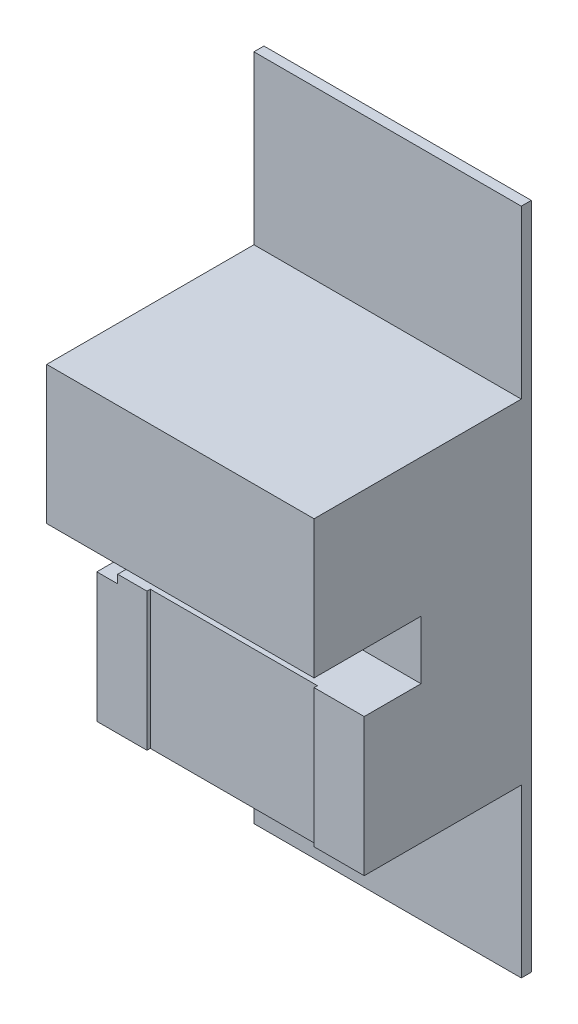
ISO-10303-21;
HEADER;
FILE_DESCRIPTION(('STEP AP214'),'2;1');
FILE_NAME('part.step','',(''),(''),'','','');
FILE_SCHEMA(('AUTOMOTIVE_DESIGN { 1 0 10303 214 1 1 1 1 }'));
ENDSEC;
DATA;
#1=APPLICATION_CONTEXT('core data for automotive mechanical design processes');
#2=APPLICATION_PROTOCOL_DEFINITION('international standard','automotive_design',2000,#1);
#3=PRODUCT_CONTEXT('',#1,'mechanical');
#4=PRODUCT('Part','Part','',(#3));
#5=PRODUCT_RELATED_PRODUCT_CATEGORY('part','',(#4));
#6=PRODUCT_DEFINITION_FORMATION('','',#4);
#7=PRODUCT_DEFINITION_CONTEXT('part definition',#1,'design');
#8=PRODUCT_DEFINITION('design','',#6,#7);
#9=PRODUCT_DEFINITION_SHAPE('','',#8);
#10=(LENGTH_UNIT() NAMED_UNIT(*) SI_UNIT(.MILLI.,.METRE.));
#11=(NAMED_UNIT(*) PLANE_ANGLE_UNIT() SI_UNIT($,.RADIAN.));
#12=(NAMED_UNIT(*) SI_UNIT($,.STERADIAN.) SOLID_ANGLE_UNIT());
#13=UNCERTAINTY_MEASURE_WITH_UNIT(LENGTH_MEASURE(1.E-05),#10,'distance_accuracy_value','');
#14=(GEOMETRIC_REPRESENTATION_CONTEXT(3) GLOBAL_UNCERTAINTY_ASSIGNED_CONTEXT((#13)) GLOBAL_UNIT_ASSIGNED_CONTEXT((#10,
#11,#12)) REPRESENTATION_CONTEXT('',''));
#15=CARTESIAN_POINT('',(0.,0.,0.));
#16=DIRECTION('',(0.,0.,1.));
#17=DIRECTION('',(1.,0.,0.));
#18=AXIS2_PLACEMENT_3D('',#15,#16,#17);
#19=CARTESIAN_POINT('',(0.,0.,10.));
#20=DIRECTION('',(0.,0.,1.));
#21=DIRECTION('',(1.,0.,0.));
#22=AXIS2_PLACEMENT_3D('',#19,#20,#21);
#23=PLANE('',#22);
#24=DIRECTION('',(0.,1.,0.));
#25=VECTOR('',#24,1.);
#26=CARTESIAN_POINT('',(1.25,18.25,10.));
#27=LINE('',#26,#25);
#28=CARTESIAN_POINT('',(1.25,17.75,10.));
#29=VERTEX_POINT('',#28);
#30=CARTESIAN_POINT('',(1.25,18.25,10.));
#31=VERTEX_POINT('',#30);
#32=EDGE_CURVE('E206',#29,#31,#27,.T.);
#33=ORIENTED_EDGE('',*,*,#32,.F.);
#34=DIRECTION('',(1.,0.,0.));
#35=VECTOR('',#34,1.);
#36=CARTESIAN_POINT('',(0.,17.75,10.));
#37=LINE('',#36,#35);
#38=CARTESIAN_POINT('',(0.,17.75,10.));
#39=VERTEX_POINT('',#38);
#40=EDGE_CURVE('E443',#39,#29,#37,.T.);
#41=ORIENTED_EDGE('',*,*,#40,.F.);
#42=DIRECTION('',(0.,1.,0.));
#43=VECTOR('',#42,1.);
#44=CARTESIAN_POINT('',(0.,0.,10.));
#45=LINE('',#44,#43);
#46=CARTESIAN_POINT('',(0.,10.,10.));
#47=VERTEX_POINT('',#46);
#48=EDGE_CURVE('E212',#47,#39,#45,.T.);
#49=ORIENTED_EDGE('',*,*,#48,.F.);
#50=DIRECTION('',(-1.,0.,0.));
#51=VECTOR('',#50,1.);
#52=CARTESIAN_POINT('',(0.,10.,10.));
#53=LINE('',#52,#51);
#54=CARTESIAN_POINT('',(3.,10.,10.));
#55=VERTEX_POINT('',#54);
#56=EDGE_CURVE('E244',#55,#47,#53,.T.);
#57=ORIENTED_EDGE('',*,*,#56,.F.);
#58=DIRECTION('',(0.,-1.,0.));
#59=VECTOR('',#58,1.);
#60=CARTESIAN_POINT('',(3.,18.25,10.));
#61=LINE('',#60,#59);
#62=CARTESIAN_POINT('',(3.,18.25,10.));
#63=VERTEX_POINT('',#62);
#64=EDGE_CURVE('E231',#63,#55,#61,.T.);
#65=ORIENTED_EDGE('',*,*,#64,.F.);
#66=DIRECTION('',(1.,0.,0.));
#67=VECTOR('',#66,1.);
#68=CARTESIAN_POINT('',(0.,18.25,10.));
#69=LINE('',#68,#67);
#70=EDGE_CURVE('E305',#31,#63,#69,.T.);
#71=ORIENTED_EDGE('',*,*,#70,.F.);
#72=EDGE_LOOP('',(#33,#41,#49,#57,#65,#71));
#73=FACE_BOUND('',#72,.T.);
#74=ADVANCED_FACE('F35',(#73),#23,.T.);
#75=CARTESIAN_POINT('',(0.,0.,10.));
#76=DIRECTION('',(0.,1.,0.));
#77=DIRECTION('',(0.,0.,1.));
#78=AXIS2_PLACEMENT_3D('',#75,#76,#77);
#79=PLANE('',#78);
#80=DIRECTION('',(-1.,0.,0.));
#81=VECTOR('',#80,1.);
#82=CARTESIAN_POINT('',(0.,0.,0.6));
#83=LINE('',#82,#81);
#84=CARTESIAN_POINT('',(16.,0.,0.6));
#85=VERTEX_POINT('',#84);
#86=CARTESIAN_POINT('',(0.,0.,0.6));
#87=VERTEX_POINT('',#86);
#88=EDGE_CURVE('E261',#85,#87,#83,.T.);
#89=ORIENTED_EDGE('',*,*,#88,.T.);
#90=DIRECTION('',(0.,0.,-1.));
#91=VECTOR('',#90,1.);
#92=CARTESIAN_POINT('',(0.,0.,10.));
#93=LINE('',#92,#91);
#94=CARTESIAN_POINT('',(0.,0.,0.));
#95=VERTEX_POINT('',#94);
#96=EDGE_CURVE('E330',#87,#95,#93,.T.);
#97=ORIENTED_EDGE('',*,*,#96,.T.);
#98=DIRECTION('',(1.,0.,0.));
#99=VECTOR('',#98,1.);
#100=CARTESIAN_POINT('',(0.,0.,0.));
#101=LINE('',#100,#99);
#102=CARTESIAN_POINT('',(16.,0.,0.));
#103=VERTEX_POINT('',#102);
#104=EDGE_CURVE('E318',#95,#103,#101,.T.);
#105=ORIENTED_EDGE('',*,*,#104,.T.);
#106=DIRECTION('',(0.,0.,-1.));
#107=VECTOR('',#106,1.);
#108=CARTESIAN_POINT('',(16.,0.,10.));
#109=LINE('',#108,#107);
#110=EDGE_CURVE('E346',#85,#103,#109,.T.);
#111=ORIENTED_EDGE('',*,*,#110,.F.);
#112=EDGE_LOOP('',(#89,#97,#105,#111));
#113=FACE_BOUND('',#112,.T.);
#114=ADVANCED_FACE('F37',(#113),#79,.F.);
#115=CARTESIAN_POINT('',(0.,40.,10.));
#116=DIRECTION('',(0.,1.,0.));
#117=DIRECTION('',(0.,0.,1.));
#118=AXIS2_PLACEMENT_3D('',#115,#116,#117);
#119=PLANE('',#118);
#120=DIRECTION('',(0.,0.,-1.));
#121=VECTOR('',#120,1.);
#122=CARTESIAN_POINT('',(0.,40.,10.));
#123=LINE('',#122,#121);
#124=CARTESIAN_POINT('',(0.,40.,0.6));
#125=VERTEX_POINT('',#124);
#126=CARTESIAN_POINT('',(0.,40.,0.));
#127=VERTEX_POINT('',#126);
#128=EDGE_CURVE('E342',#125,#127,#123,.T.);
#129=ORIENTED_EDGE('',*,*,#128,.F.);
#130=DIRECTION('',(1.,0.,0.));
#131=VECTOR('',#130,1.);
#132=CARTESIAN_POINT('',(0.,40.,0.6));
#133=LINE('',#132,#131);
#134=CARTESIAN_POINT('',(16.,40.,0.6));
#135=VERTEX_POINT('',#134);
#136=EDGE_CURVE('E250',#125,#135,#133,.T.);
#137=ORIENTED_EDGE('',*,*,#136,.T.);
#138=DIRECTION('',(0.,0.,-1.));
#139=VECTOR('',#138,1.);
#140=CARTESIAN_POINT('',(16.,40.,10.));
#141=LINE('',#140,#139);
#142=CARTESIAN_POINT('',(16.,40.,0.));
#143=VERTEX_POINT('',#142);
#144=EDGE_CURVE('E344',#135,#143,#141,.T.);
#145=ORIENTED_EDGE('',*,*,#144,.T.);
#146=DIRECTION('',(1.,0.,0.));
#147=VECTOR('',#146,1.);
#148=CARTESIAN_POINT('',(0.,40.,0.));
#149=LINE('',#148,#147);
#150=EDGE_CURVE('E336',#127,#143,#149,.T.);
#151=ORIENTED_EDGE('',*,*,#150,.F.);
#152=EDGE_LOOP('',(#129,#137,#145,#151));
#153=FACE_BOUND('',#152,.T.);
#154=ADVANCED_FACE('F396',(#153),#119,.T.);
#155=CARTESIAN_POINT('',(16.,0.,10.));
#156=DIRECTION('',(-1.,0.,0.));
#157=DIRECTION('',(0.,0.,1.));
#158=AXIS2_PLACEMENT_3D('',#155,#156,#157);
#159=PLANE('',#158);
#160=DIRECTION('',(0.,-1.,0.));
#161=VECTOR('',#160,1.);
#162=CARTESIAN_POINT('',(16.,40.,0.6));
#163=LINE('',#162,#161);
#164=CARTESIAN_POINT('',(16.,30.,0.6));
#165=VERTEX_POINT('',#164);
#166=EDGE_CURVE('E247',#135,#165,#163,.T.);
#167=ORIENTED_EDGE('',*,*,#166,.T.);
#168=DIRECTION('',(0.,0.,1.));
#169=VECTOR('',#168,1.);
#170=CARTESIAN_POINT('',(16.,30.,-18.8679622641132));
#171=LINE('',#170,#169);
#172=CARTESIAN_POINT('',(16.,30.,13.));
#173=VERTEX_POINT('',#172);
#174=EDGE_CURVE('E251',#165,#173,#171,.T.);
#175=ORIENTED_EDGE('',*,*,#174,.T.);
#176=DIRECTION('',(0.,1.,0.));
#177=VECTOR('',#176,1.);
#178=CARTESIAN_POINT('',(16.,30.,13.));
#179=LINE('',#178,#177);
#180=CARTESIAN_POINT('',(16.,21.75,13.));
#181=VERTEX_POINT('',#180);
#182=EDGE_CURVE('E225',#181,#173,#179,.T.);
#183=ORIENTED_EDGE('',*,*,#182,.F.);
#184=DIRECTION('',(0.,0.,1.));
#185=VECTOR('',#184,1.);
#186=CARTESIAN_POINT('',(16.,21.75,6.6));
#187=LINE('',#186,#185);
#188=CARTESIAN_POINT('',(16.,21.75,6.6));
#189=VERTEX_POINT('',#188);
#190=EDGE_CURVE('E319',#189,#181,#187,.T.);
#191=ORIENTED_EDGE('',*,*,#190,.F.);
#192=DIRECTION('',(0.,1.,0.));
#193=VECTOR('',#192,1.);
#194=CARTESIAN_POINT('',(16.,21.75,6.6));
#195=LINE('',#194,#193);
#196=CARTESIAN_POINT('',(16.,18.25,6.6));
#197=VERTEX_POINT('',#196);
#198=EDGE_CURVE('E308',#197,#189,#195,.T.);
#199=ORIENTED_EDGE('',*,*,#198,.F.);
#200=DIRECTION('',(0.,0.,1.));
#201=VECTOR('',#200,1.);
#202=CARTESIAN_POINT('',(16.,18.25,6.6));
#203=LINE('',#202,#201);
#204=CARTESIAN_POINT('',(16.,18.25,10.));
#205=VERTEX_POINT('',#204);
#206=EDGE_CURVE('E321',#197,#205,#203,.T.);
#207=ORIENTED_EDGE('',*,*,#206,.T.);
#208=DIRECTION('',(0.,1.,0.));
#209=VECTOR('',#208,1.);
#210=CARTESIAN_POINT('',(16.,0.,10.));
#211=LINE('',#210,#209);
#212=CARTESIAN_POINT('',(16.,10.,10.));
#213=VERTEX_POINT('',#212);
#214=EDGE_CURVE('E325',#213,#205,#211,.T.);
#215=ORIENTED_EDGE('',*,*,#214,.F.);
#216=DIRECTION('',(0.,0.,1.));
#217=VECTOR('',#216,1.);
#218=CARTESIAN_POINT('',(16.,10.,-18.8679622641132));
#219=LINE('',#218,#217);
#220=CARTESIAN_POINT('',(16.,10.,0.6));
#221=VERTEX_POINT('',#220);
#222=EDGE_CURVE('E276',#221,#213,#219,.T.);
#223=ORIENTED_EDGE('',*,*,#222,.F.);
#224=DIRECTION('',(0.,-1.,0.));
#225=VECTOR('',#224,1.);
#226=CARTESIAN_POINT('',(16.,0.,0.6));
#227=LINE('',#226,#225);
#228=EDGE_CURVE('E264',#221,#85,#227,.T.);
#229=ORIENTED_EDGE('',*,*,#228,.T.);
#230=ORIENTED_EDGE('',*,*,#110,.T.);
#231=DIRECTION('',(0.,1.,0.));
#232=VECTOR('',#231,1.);
#233=CARTESIAN_POINT('',(16.,0.,0.));
#234=LINE('',#233,#232);
#235=EDGE_CURVE('E333',#103,#143,#234,.T.);
#236=ORIENTED_EDGE('',*,*,#235,.T.);
#237=ORIENTED_EDGE('',*,*,#144,.F.);
#238=EDGE_LOOP('',(#167,#175,#183,#191,#199,#207,#215,#223,#229,#230,#236,#237));
#239=FACE_BOUND('',#238,.T.);
#240=ADVANCED_FACE('F409',(#239),#159,.F.);
#241=CARTESIAN_POINT('',(0.,0.,10.));
#242=DIRECTION('',(-1.,0.,0.));
#243=DIRECTION('',(0.,0.,1.));
#244=AXIS2_PLACEMENT_3D('',#241,#242,#243);
#245=PLANE('',#244);
#246=DIRECTION('',(0.,0.,1.));
#247=VECTOR('',#246,1.);
#248=CARTESIAN_POINT('',(0.,17.75,9.));
#249=LINE('',#248,#247);
#250=CARTESIAN_POINT('',(0.,17.75,9.));
#251=VERTEX_POINT('',#250);
#252=EDGE_CURVE('E194',#251,#39,#249,.T.);
#253=ORIENTED_EDGE('',*,*,#252,.F.);
#254=DIRECTION('',(0.,-1.,0.));
#255=VECTOR('',#254,1.);
#256=CARTESIAN_POINT('',(0.,18.25,9.));
#257=LINE('',#256,#255);
#258=CARTESIAN_POINT('',(0.,18.25,9.));
#259=VERTEX_POINT('',#258);
#260=EDGE_CURVE('E197',#259,#251,#257,.T.);
#261=ORIENTED_EDGE('',*,*,#260,.F.);
#262=DIRECTION('',(0.,0.,1.));
#263=VECTOR('',#262,1.);
#264=CARTESIAN_POINT('',(0.,18.25,6.6));
#265=LINE('',#264,#263);
#266=CARTESIAN_POINT('',(0.,18.25,6.6));
#267=VERTEX_POINT('',#266);
#268=EDGE_CURVE('E314',#267,#259,#265,.T.);
#269=ORIENTED_EDGE('',*,*,#268,.F.);
#270=DIRECTION('',(0.,-1.,0.));
#271=VECTOR('',#270,1.);
#272=CARTESIAN_POINT('',(0.,21.75,6.6));
#273=LINE('',#272,#271);
#274=CARTESIAN_POINT('',(0.,21.75,6.6));
#275=VERTEX_POINT('',#274);
#276=EDGE_CURVE('E301',#275,#267,#273,.T.);
#277=ORIENTED_EDGE('',*,*,#276,.F.);
#278=DIRECTION('',(0.,0.,1.));
#279=VECTOR('',#278,1.);
#280=CARTESIAN_POINT('',(0.,21.75,6.6));
#281=LINE('',#280,#279);
#282=CARTESIAN_POINT('',(0.,21.75,13.));
#283=VERTEX_POINT('',#282);
#284=EDGE_CURVE('E316',#275,#283,#281,.T.);
#285=ORIENTED_EDGE('',*,*,#284,.T.);
#286=DIRECTION('',(0.,-1.,0.));
#287=VECTOR('',#286,1.);
#288=CARTESIAN_POINT('',(0.,30.,13.));
#289=LINE('',#288,#287);
#290=CARTESIAN_POINT('',(0.,30.,13.));
#291=VERTEX_POINT('',#290);
#292=EDGE_CURVE('E219',#291,#283,#289,.T.);
#293=ORIENTED_EDGE('',*,*,#292,.F.);
#294=DIRECTION('',(0.,0.,1.));
#295=VECTOR('',#294,1.);
#296=CARTESIAN_POINT('',(0.,30.,-18.8679622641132));
#297=LINE('',#296,#295);
#298=CARTESIAN_POINT('',(0.,30.,0.6));
#299=VERTEX_POINT('',#298);
#300=EDGE_CURVE('E259',#299,#291,#297,.T.);
#301=ORIENTED_EDGE('',*,*,#300,.F.);
#302=DIRECTION('',(0.,1.,0.));
#303=VECTOR('',#302,1.);
#304=CARTESIAN_POINT('',(0.,40.,0.6));
#305=LINE('',#304,#303);
#306=EDGE_CURVE('E254',#299,#125,#305,.T.);
#307=ORIENTED_EDGE('',*,*,#306,.T.);
#308=ORIENTED_EDGE('',*,*,#128,.T.);
#309=DIRECTION('',(0.,1.,0.));
#310=VECTOR('',#309,1.);
#311=CARTESIAN_POINT('',(0.,0.,0.));
#312=LINE('',#311,#310);
#313=EDGE_CURVE('E328',#95,#127,#312,.T.);
#314=ORIENTED_EDGE('',*,*,#313,.F.);
#315=ORIENTED_EDGE('',*,*,#96,.F.);
#316=DIRECTION('',(0.,1.,0.));
#317=VECTOR('',#316,1.);
#318=CARTESIAN_POINT('',(0.,0.,0.6));
#319=LINE('',#318,#317);
#320=CARTESIAN_POINT('',(0.,10.,0.6));
#321=VERTEX_POINT('',#320);
#322=EDGE_CURVE('E270',#87,#321,#319,.T.);
#323=ORIENTED_EDGE('',*,*,#322,.T.);
#324=DIRECTION('',(0.,0.,1.));
#325=VECTOR('',#324,1.);
#326=CARTESIAN_POINT('',(0.,10.,-18.8679622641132));
#327=LINE('',#326,#325);
#328=EDGE_CURVE('E268',#321,#47,#327,.T.);
#329=ORIENTED_EDGE('',*,*,#328,.T.);
#330=ORIENTED_EDGE('',*,*,#48,.T.);
#331=EDGE_LOOP('',(#253,#261,#269,#277,#285,#293,#301,#307,#308,#314,#315,#323,#329,#330));
#332=FACE_BOUND('',#331,.T.);
#333=ADVANCED_FACE('F209',(#332),#245,.T.);
#334=DIRECTION('',(0.,1.,0.));
#335=VECTOR('',#334,1.);
#336=CARTESIAN_POINT('',(13.,18.25,10.));
#337=LINE('',#336,#335);
#338=CARTESIAN_POINT('',(13.,10.,10.));
#339=VERTEX_POINT('',#338);
#340=CARTESIAN_POINT('',(13.,18.25,10.));
#341=VERTEX_POINT('',#340);
#342=EDGE_CURVE('E234',#339,#341,#337,.T.);
#343=ORIENTED_EDGE('',*,*,#342,.F.);
#344=EDGE_CURVE('E273',#213,#339,#53,.T.);
#345=ORIENTED_EDGE('',*,*,#344,.F.);
#346=ORIENTED_EDGE('',*,*,#214,.T.);
#347=EDGE_CURVE('E298',#341,#205,#69,.T.);
#348=ORIENTED_EDGE('',*,*,#347,.F.);
#349=EDGE_LOOP('',(#343,#345,#346,#348));
#350=FACE_BOUND('',#349,.T.);
#351=ADVANCED_FACE('F369',(#350),#23,.T.);
#352=CARTESIAN_POINT('',(0.,0.,0.));
#353=DIRECTION('',(0.,0.,1.));
#354=DIRECTION('',(1.,0.,0.));
#355=AXIS2_PLACEMENT_3D('',#352,#353,#354);
#356=PLANE('',#355);
#357=ORIENTED_EDGE('',*,*,#104,.F.);
#358=ORIENTED_EDGE('',*,*,#313,.T.);
#359=ORIENTED_EDGE('',*,*,#150,.T.);
#360=ORIENTED_EDGE('',*,*,#235,.F.);
#361=EDGE_LOOP('',(#357,#358,#359,#360));
#362=FACE_BOUND('',#361,.T.);
#363=ADVANCED_FACE('F402',(#362),#356,.F.);
#364=CARTESIAN_POINT('',(0.,21.75,6.6));
#365=DIRECTION('',(0.,1.,0.));
#366=DIRECTION('',(0.,0.,1.));
#367=AXIS2_PLACEMENT_3D('',#364,#365,#366);
#368=PLANE('',#367);
#369=ORIENTED_EDGE('',*,*,#190,.T.);
#370=DIRECTION('',(1.,0.,0.));
#371=VECTOR('',#370,1.);
#372=CARTESIAN_POINT('',(0.,21.75,13.));
#373=LINE('',#372,#371);
#374=EDGE_CURVE('E222',#283,#181,#373,.T.);
#375=ORIENTED_EDGE('',*,*,#374,.F.);
#376=ORIENTED_EDGE('',*,*,#284,.F.);
#377=DIRECTION('',(-1.,0.,0.));
#378=VECTOR('',#377,1.);
#379=CARTESIAN_POINT('',(0.,21.75,6.6));
#380=LINE('',#379,#378);
#381=CARTESIAN_POINT('',(6.2,21.75,6.6));
#382=VERTEX_POINT('',#381);
#383=EDGE_CURVE('E310',#382,#275,#380,.T.);
#384=ORIENTED_EDGE('',*,*,#383,.F.);
#385=DIRECTION('',(0.,0.,1.));
#386=VECTOR('',#385,1.);
#387=CARTESIAN_POINT('',(6.2,21.75,6.6));
#388=LINE('',#387,#386);
#389=CARTESIAN_POINT('',(6.2,21.75,5.6));
#390=VERTEX_POINT('',#389);
#391=EDGE_CURVE('E263',#390,#382,#388,.T.);
#392=ORIENTED_EDGE('',*,*,#391,.F.);
#393=CARTESIAN_POINT('',(7.99999999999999,21.75,5.6));
#394=DIRECTION('',(0.,1.,0.));
#395=DIRECTION('',(0.,0.,1.));
#396=AXIS2_PLACEMENT_3D('',#393,#394,#395);
#397=CIRCLE('',#396,1.8);
#398=CARTESIAN_POINT('',(9.79999999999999,21.75,5.6));
#399=VERTEX_POINT('',#398);
#400=EDGE_CURVE('E285',#399,#390,#397,.T.);
#401=ORIENTED_EDGE('',*,*,#400,.F.);
#402=DIRECTION('',(0.,0.,-1.));
#403=VECTOR('',#402,1.);
#404=CARTESIAN_POINT('',(9.8,21.75,6.6));
#405=LINE('',#404,#403);
#406=CARTESIAN_POINT('',(9.8,21.75,6.6));
#407=VERTEX_POINT('',#406);
#408=EDGE_CURVE('E292',#407,#399,#405,.T.);
#409=ORIENTED_EDGE('',*,*,#408,.F.);
#410=EDGE_CURVE('E311',#189,#407,#380,.T.);
#411=ORIENTED_EDGE('',*,*,#410,.F.);
#412=EDGE_LOOP('',(#369,#375,#376,#384,#392,#401,#409,#411));
#413=FACE_BOUND('',#412,.T.);
#414=ADVANCED_FACE('F407',(#413),#368,.F.);
#415=CARTESIAN_POINT('',(0.,18.25,6.6));
#416=DIRECTION('',(0.,-1.,0.));
#417=DIRECTION('',(0.,0.,-1.));
#418=AXIS2_PLACEMENT_3D('',#415,#416,#417);
#419=PLANE('',#418);
#420=DIRECTION('',(-1.,0.,0.));
#421=VECTOR('',#420,1.);
#422=CARTESIAN_POINT('',(0.,18.25,9.));
#423=LINE('',#422,#421);
#424=CARTESIAN_POINT('',(1.25,18.25,9.));
#425=VERTEX_POINT('',#424);
#426=EDGE_CURVE('E202',#425,#259,#423,.T.);
#427=ORIENTED_EDGE('',*,*,#426,.F.);
#428=DIRECTION('',(0.,0.,1.));
#429=VECTOR('',#428,1.);
#430=CARTESIAN_POINT('',(1.25,18.25,9.));
#431=LINE('',#430,#429);
#432=EDGE_CURVE('E214',#425,#31,#431,.T.);
#433=ORIENTED_EDGE('',*,*,#432,.T.);
#434=ORIENTED_EDGE('',*,*,#70,.T.);
#435=DIRECTION('',(0.,0.,1.));
#436=VECTOR('',#435,1.);
#437=CARTESIAN_POINT('',(3.,18.25,9.8));
#438=LINE('',#437,#436);
#439=CARTESIAN_POINT('',(3.,18.25,9.8));
#440=VERTEX_POINT('',#439);
#441=EDGE_CURVE('E241',#440,#63,#438,.T.);
#442=ORIENTED_EDGE('',*,*,#441,.F.);
#443=DIRECTION('',(-1.,0.,0.));
#444=VECTOR('',#443,1.);
#445=CARTESIAN_POINT('',(3.,18.25,9.8));
#446=LINE('',#445,#444);
#447=CARTESIAN_POINT('',(13.,18.25,9.8));
#448=VERTEX_POINT('',#447);
#449=EDGE_CURVE('E236',#448,#440,#446,.T.);
#450=ORIENTED_EDGE('',*,*,#449,.F.);
#451=DIRECTION('',(0.,0.,1.));
#452=VECTOR('',#451,1.);
#453=CARTESIAN_POINT('',(13.,18.25,9.8));
#454=LINE('',#453,#452);
#455=EDGE_CURVE('E238',#448,#341,#454,.T.);
#456=ORIENTED_EDGE('',*,*,#455,.T.);
#457=ORIENTED_EDGE('',*,*,#347,.T.);
#458=ORIENTED_EDGE('',*,*,#206,.F.);
#459=DIRECTION('',(1.,0.,0.));
#460=VECTOR('',#459,1.);
#461=CARTESIAN_POINT('',(0.,18.25,6.6));
#462=LINE('',#461,#460);
#463=EDGE_CURVE('E304',#267,#197,#462,.T.);
#464=ORIENTED_EDGE('',*,*,#463,.F.);
#465=ORIENTED_EDGE('',*,*,#268,.T.);
#466=EDGE_LOOP('',(#427,#433,#434,#442,#450,#456,#457,#458,#464,#465));
#467=FACE_BOUND('',#466,.T.);
#468=ADVANCED_FACE('F372',(#467),#419,.F.);
#469=CARTESIAN_POINT('',(0.,0.,6.6));
#470=DIRECTION('',(0.,0.,1.));
#471=DIRECTION('',(1.,0.,0.));
#472=AXIS2_PLACEMENT_3D('',#469,#470,#471);
#473=PLANE('',#472);
#474=DIRECTION('',(0.,-1.,0.));
#475=VECTOR('',#474,1.);
#476=CARTESIAN_POINT('',(6.2,0.,6.6));
#477=LINE('',#476,#475);
#478=CARTESIAN_POINT('',(6.2,18.35,6.6));
#479=VERTEX_POINT('',#478);
#480=EDGE_CURVE('E354',#382,#479,#477,.T.);
#481=ORIENTED_EDGE('',*,*,#480,.F.);
#482=ORIENTED_EDGE('',*,*,#383,.T.);
#483=ORIENTED_EDGE('',*,*,#276,.T.);
#484=ORIENTED_EDGE('',*,*,#463,.T.);
#485=ORIENTED_EDGE('',*,*,#198,.T.);
#486=ORIENTED_EDGE('',*,*,#410,.T.);
#487=DIRECTION('',(0.,1.,0.));
#488=VECTOR('',#487,1.);
#489=CARTESIAN_POINT('',(9.8,0.,6.6));
#490=LINE('',#489,#488);
#491=CARTESIAN_POINT('',(9.8,18.35,6.6));
#492=VERTEX_POINT('',#491);
#493=EDGE_CURVE('E351',#492,#407,#490,.T.);
#494=ORIENTED_EDGE('',*,*,#493,.F.);
#495=DIRECTION('',(-1.,0.,0.));
#496=VECTOR('',#495,1.);
#497=CARTESIAN_POINT('',(0.,18.35,6.6));
#498=LINE('',#497,#496);
#499=EDGE_CURVE('E348',#492,#479,#498,.T.);
#500=ORIENTED_EDGE('',*,*,#499,.T.);
#501=EDGE_LOOP('',(#481,#482,#483,#484,#485,#486,#494,#500));
#502=FACE_BOUND('',#501,.T.);
#503=ADVANCED_FACE('F474',(#502),#473,.T.);
#504=CARTESIAN_POINT('',(6.2,18.35,6.6));
#505=DIRECTION('',(-1.,0.,0.));
#506=DIRECTION('',(0.,0.,1.));
#507=AXIS2_PLACEMENT_3D('',#504,#505,#506);
#508=PLANE('',#507);
#509=ORIENTED_EDGE('',*,*,#480,.T.);
#510=DIRECTION('',(0.,0.,1.));
#511=VECTOR('',#510,1.);
#512=CARTESIAN_POINT('',(6.2,18.35,6.6));
#513=LINE('',#512,#511);
#514=CARTESIAN_POINT('',(6.2,18.35,5.6));
#515=VERTEX_POINT('',#514);
#516=EDGE_CURVE('E281',#515,#479,#513,.T.);
#517=ORIENTED_EDGE('',*,*,#516,.F.);
#518=DIRECTION('',(0.,1.,0.));
#519=VECTOR('',#518,1.);
#520=CARTESIAN_POINT('',(6.2,18.35,5.6));
#521=LINE('',#520,#519);
#522=EDGE_CURVE('E296',#515,#390,#521,.T.);
#523=ORIENTED_EDGE('',*,*,#522,.T.);
#524=ORIENTED_EDGE('',*,*,#391,.T.);
#525=EDGE_LOOP('',(#509,#517,#523,#524));
#526=FACE_BOUND('',#525,.T.);
#527=ADVANCED_FACE('F488',(#526),#508,.F.);
#528=CARTESIAN_POINT('',(7.99999999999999,18.35,5.6));
#529=DIRECTION('',(0.,1.,0.));
#530=DIRECTION('',(0.,0.,1.));
#531=AXIS2_PLACEMENT_3D('',#528,#529,#530);
#532=CYLINDRICAL_SURFACE('',#531,1.8);
#533=ORIENTED_EDGE('',*,*,#400,.T.);
#534=ORIENTED_EDGE('',*,*,#522,.F.);
#535=CARTESIAN_POINT('',(7.99999999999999,18.35,5.6));
#536=DIRECTION('',(0.,1.,0.));
#537=DIRECTION('',(0.,0.,1.));
#538=AXIS2_PLACEMENT_3D('',#535,#536,#537);
#539=CIRCLE('',#538,1.8);
#540=CARTESIAN_POINT('',(9.79999999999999,18.35,5.6));
#541=VERTEX_POINT('',#540);
#542=EDGE_CURVE('E287',#541,#515,#539,.T.);
#543=ORIENTED_EDGE('',*,*,#542,.F.);
#544=DIRECTION('',(0.,1.,0.));
#545=VECTOR('',#544,1.);
#546=CARTESIAN_POINT('',(9.79999999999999,18.35,5.6));
#547=LINE('',#546,#545);
#548=EDGE_CURVE('E290',#541,#399,#547,.T.);
#549=ORIENTED_EDGE('',*,*,#548,.T.);
#550=EDGE_LOOP('',(#533,#534,#543,#549));
#551=FACE_BOUND('',#550,.T.);
#552=ADVANCED_FACE('F496',(#551),#532,.F.);
#553=CARTESIAN_POINT('',(9.8,18.35,6.6));
#554=DIRECTION('',(1.,0.,0.));
#555=DIRECTION('',(0.,0.,-1.));
#556=AXIS2_PLACEMENT_3D('',#553,#554,#555);
#557=PLANE('',#556);
#558=ORIENTED_EDGE('',*,*,#493,.T.);
#559=ORIENTED_EDGE('',*,*,#408,.T.);
#560=ORIENTED_EDGE('',*,*,#548,.F.);
#561=DIRECTION('',(0.,0.,-1.));
#562=VECTOR('',#561,1.);
#563=CARTESIAN_POINT('',(9.8,18.35,6.6));
#564=LINE('',#563,#562);
#565=EDGE_CURVE('E284',#492,#541,#564,.T.);
#566=ORIENTED_EDGE('',*,*,#565,.F.);
#567=EDGE_LOOP('',(#558,#559,#560,#566));
#568=FACE_BOUND('',#567,.T.);
#569=ADVANCED_FACE('F504',(#568),#557,.F.);
#570=CARTESIAN_POINT('',(8.,18.35,14.4));
#571=DIRECTION('',(0.,1.,0.));
#572=DIRECTION('',(0.,0.,1.));
#573=AXIS2_PLACEMENT_3D('',#570,#571,#572);
#574=PLANE('',#573);
#575=ORIENTED_EDGE('',*,*,#565,.T.);
#576=ORIENTED_EDGE('',*,*,#542,.T.);
#577=ORIENTED_EDGE('',*,*,#516,.T.);
#578=ORIENTED_EDGE('',*,*,#499,.F.);
#579=EDGE_LOOP('',(#575,#576,#577,#578));
#580=FACE_BOUND('',#579,.T.);
#581=ADVANCED_FACE('F512',(#580),#574,.T.);
#582=CARTESIAN_POINT('',(0.,10.,-18.8679622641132));
#583=DIRECTION('',(0.,1.,0.));
#584=DIRECTION('',(0.,0.,1.));
#585=AXIS2_PLACEMENT_3D('',#582,#583,#584);
#586=PLANE('',#585);
#587=DIRECTION('',(1.,0.,0.));
#588=VECTOR('',#587,1.);
#589=CARTESIAN_POINT('',(0.,10.,9.8));
#590=LINE('',#589,#588);
#591=CARTESIAN_POINT('',(3.,10.,9.8));
#592=VERTEX_POINT('',#591);
#593=CARTESIAN_POINT('',(13.,10.,9.8));
#594=VERTEX_POINT('',#593);
#595=EDGE_CURVE('E356',#592,#594,#590,.T.);
#596=ORIENTED_EDGE('',*,*,#595,.F.);
#597=DIRECTION('',(0.,0.,1.));
#598=VECTOR('',#597,1.);
#599=CARTESIAN_POINT('',(3.,10.,-18.8679622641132));
#600=LINE('',#599,#598);
#601=EDGE_CURVE('E12',#592,#55,#600,.T.);
#602=ORIENTED_EDGE('',*,*,#601,.T.);
#603=ORIENTED_EDGE('',*,*,#56,.T.);
#604=ORIENTED_EDGE('',*,*,#328,.F.);
#605=DIRECTION('',(1.,0.,0.));
#606=VECTOR('',#605,1.);
#607=CARTESIAN_POINT('',(0.,10.,0.6));
#608=LINE('',#607,#606);
#609=EDGE_CURVE('E267',#321,#221,#608,.T.);
#610=ORIENTED_EDGE('',*,*,#609,.T.);
#611=ORIENTED_EDGE('',*,*,#222,.T.);
#612=ORIENTED_EDGE('',*,*,#344,.T.);
#613=DIRECTION('',(0.,0.,-1.));
#614=VECTOR('',#613,1.);
#615=CARTESIAN_POINT('',(13.,10.,-18.8679622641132));
#616=LINE('',#615,#614);
#617=EDGE_CURVE('E43',#339,#594,#616,.T.);
#618=ORIENTED_EDGE('',*,*,#617,.T.);
#619=EDGE_LOOP('',(#596,#602,#603,#604,#610,#611,#612,#618));
#620=FACE_BOUND('',#619,.T.);
#621=ADVANCED_FACE('F360',(#620),#586,.F.);
#622=CARTESIAN_POINT('',(0.,0.,0.6));
#623=DIRECTION('',(0.,0.,1.));
#624=DIRECTION('',(1.,0.,0.));
#625=AXIS2_PLACEMENT_3D('',#622,#623,#624);
#626=PLANE('',#625);
#627=ORIENTED_EDGE('',*,*,#322,.F.);
#628=ORIENTED_EDGE('',*,*,#88,.F.);
#629=ORIENTED_EDGE('',*,*,#228,.F.);
#630=ORIENTED_EDGE('',*,*,#609,.F.);
#631=EDGE_LOOP('',(#627,#628,#629,#630));
#632=FACE_BOUND('',#631,.T.);
#633=ADVANCED_FACE('F437',(#632),#626,.T.);
#634=CARTESIAN_POINT('',(0.,30.,-18.8679622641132));
#635=DIRECTION('',(0.,-1.,0.));
#636=DIRECTION('',(0.,0.,-1.));
#637=AXIS2_PLACEMENT_3D('',#634,#635,#636);
#638=PLANE('',#637);
#639=DIRECTION('',(-1.,0.,0.));
#640=VECTOR('',#639,1.);
#641=CARTESIAN_POINT('',(0.,30.,0.6));
#642=LINE('',#641,#640);
#643=EDGE_CURVE('E257',#165,#299,#642,.T.);
#644=ORIENTED_EDGE('',*,*,#643,.T.);
#645=ORIENTED_EDGE('',*,*,#300,.T.);
#646=DIRECTION('',(-1.,0.,0.));
#647=VECTOR('',#646,1.);
#648=CARTESIAN_POINT('',(0.,30.,13.));
#649=LINE('',#648,#647);
#650=EDGE_CURVE('E228',#173,#291,#649,.T.);
#651=ORIENTED_EDGE('',*,*,#650,.F.);
#652=ORIENTED_EDGE('',*,*,#174,.F.);
#653=EDGE_LOOP('',(#644,#645,#651,#652));
#654=FACE_BOUND('',#653,.T.);
#655=ADVANCED_FACE('F535',(#654),#638,.F.);
#656=CARTESIAN_POINT('',(0.,0.,0.6));
#657=DIRECTION('',(0.,0.,1.));
#658=DIRECTION('',(1.,0.,0.));
#659=AXIS2_PLACEMENT_3D('',#656,#657,#658);
#660=PLANE('',#659);
#661=ORIENTED_EDGE('',*,*,#306,.F.);
#662=ORIENTED_EDGE('',*,*,#643,.F.);
#663=ORIENTED_EDGE('',*,*,#166,.F.);
#664=ORIENTED_EDGE('',*,*,#136,.F.);
#665=EDGE_LOOP('',(#661,#662,#663,#664));
#666=FACE_BOUND('',#665,.T.);
#667=ADVANCED_FACE('F430',(#666),#660,.T.);
#668=CARTESIAN_POINT('',(3.,18.25,9.8));
#669=DIRECTION('',(-1.,0.,0.));
#670=DIRECTION('',(0.,-1.,0.));
#671=AXIS2_PLACEMENT_3D('',#668,#669,#670);
#672=PLANE('',#671);
#673=DIRECTION('',(0.,-1.,0.));
#674=VECTOR('',#673,1.);
#675=CARTESIAN_POINT('',(3.,18.25,9.8));
#676=LINE('',#675,#674);
#677=EDGE_CURVE('E58',#440,#592,#676,.T.);
#678=ORIENTED_EDGE('',*,*,#677,.F.);
#679=ORIENTED_EDGE('',*,*,#441,.T.);
#680=ORIENTED_EDGE('',*,*,#64,.T.);
#681=ORIENTED_EDGE('',*,*,#601,.F.);
#682=EDGE_LOOP('',(#678,#679,#680,#681));
#683=FACE_BOUND('',#682,.T.);
#684=ADVANCED_FACE('F386',(#683),#672,.F.);
#685=CARTESIAN_POINT('',(13.,18.25,9.8));
#686=DIRECTION('',(1.,0.,0.));
#687=DIRECTION('',(0.,1.,0.));
#688=AXIS2_PLACEMENT_3D('',#685,#686,#687);
#689=PLANE('',#688);
#690=ORIENTED_EDGE('',*,*,#342,.T.);
#691=ORIENTED_EDGE('',*,*,#455,.F.);
#692=DIRECTION('',(0.,1.,0.));
#693=VECTOR('',#692,1.);
#694=CARTESIAN_POINT('',(13.,18.25,9.8));
#695=LINE('',#694,#693);
#696=EDGE_CURVE('E233',#594,#448,#695,.T.);
#697=ORIENTED_EDGE('',*,*,#696,.F.);
#698=ORIENTED_EDGE('',*,*,#617,.F.);
#699=EDGE_LOOP('',(#690,#691,#697,#698));
#700=FACE_BOUND('',#699,.T.);
#701=ADVANCED_FACE('F365',(#700),#689,.F.);
#702=CARTESIAN_POINT('',(0.,0.,9.8));
#703=DIRECTION('',(0.,0.,1.));
#704=DIRECTION('',(1.,0.,0.));
#705=AXIS2_PLACEMENT_3D('',#702,#703,#704);
#706=PLANE('',#705);
#707=ORIENTED_EDGE('',*,*,#595,.T.);
#708=ORIENTED_EDGE('',*,*,#696,.T.);
#709=ORIENTED_EDGE('',*,*,#449,.T.);
#710=ORIENTED_EDGE('',*,*,#677,.T.);
#711=EDGE_LOOP('',(#707,#708,#709,#710));
#712=FACE_BOUND('',#711,.T.);
#713=ADVANCED_FACE('F375',(#712),#706,.T.);
#714=CARTESIAN_POINT('',(0.,0.,13.));
#715=DIRECTION('',(0.,0.,1.));
#716=DIRECTION('',(1.,0.,0.));
#717=AXIS2_PLACEMENT_3D('',#714,#715,#716);
#718=PLANE('',#717);
#719=ORIENTED_EDGE('',*,*,#292,.T.);
#720=ORIENTED_EDGE('',*,*,#374,.T.);
#721=ORIENTED_EDGE('',*,*,#182,.T.);
#722=ORIENTED_EDGE('',*,*,#650,.T.);
#723=EDGE_LOOP('',(#719,#720,#721,#722));
#724=FACE_BOUND('',#723,.T.);
#725=ADVANCED_FACE('F377',(#724),#718,.T.);
#726=CARTESIAN_POINT('',(1.25,18.25,9.));
#727=DIRECTION('',(1.,0.,0.));
#728=DIRECTION('',(0.,1.,0.));
#729=AXIS2_PLACEMENT_3D('',#726,#727,#728);
#730=PLANE('',#729);
#731=ORIENTED_EDGE('',*,*,#32,.T.);
#732=ORIENTED_EDGE('',*,*,#432,.F.);
#733=DIRECTION('',(0.,1.,0.));
#734=VECTOR('',#733,1.);
#735=CARTESIAN_POINT('',(1.25,18.25,9.));
#736=LINE('',#735,#734);
#737=CARTESIAN_POINT('',(1.25,17.75,9.));
#738=VERTEX_POINT('',#737);
#739=EDGE_CURVE('E50',#738,#425,#736,.T.);
#740=ORIENTED_EDGE('',*,*,#739,.F.);
#741=DIRECTION('',(0.,0.,1.));
#742=VECTOR('',#741,1.);
#743=CARTESIAN_POINT('',(1.25,17.75,9.));
#744=LINE('',#743,#742);
#745=EDGE_CURVE('E196',#738,#29,#744,.T.);
#746=ORIENTED_EDGE('',*,*,#745,.T.);
#747=EDGE_LOOP('',(#731,#732,#740,#746));
#748=FACE_BOUND('',#747,.T.);
#749=ADVANCED_FACE('F383',(#748),#730,.F.);
#750=CARTESIAN_POINT('',(0.,17.75,9.));
#751=DIRECTION('',(0.,-1.,0.));
#752=DIRECTION('',(0.,0.,-1.));
#753=AXIS2_PLACEMENT_3D('',#750,#751,#752);
#754=PLANE('',#753);
#755=ORIENTED_EDGE('',*,*,#40,.T.);
#756=ORIENTED_EDGE('',*,*,#745,.F.);
#757=DIRECTION('',(1.,0.,0.));
#758=VECTOR('',#757,1.);
#759=CARTESIAN_POINT('',(0.,17.75,9.));
#760=LINE('',#759,#758);
#761=EDGE_CURVE('E189',#251,#738,#760,.T.);
#762=ORIENTED_EDGE('',*,*,#761,.F.);
#763=ORIENTED_EDGE('',*,*,#252,.T.);
#764=EDGE_LOOP('',(#755,#756,#762,#763));
#765=FACE_BOUND('',#764,.T.);
#766=ADVANCED_FACE('F192',(#765),#754,.F.);
#767=CARTESIAN_POINT('',(0.,0.,9.));
#768=DIRECTION('',(0.,0.,1.));
#769=DIRECTION('',(1.,0.,0.));
#770=AXIS2_PLACEMENT_3D('',#767,#768,#769);
#771=PLANE('',#770);
#772=ORIENTED_EDGE('',*,*,#260,.T.);
#773=ORIENTED_EDGE('',*,*,#761,.T.);
#774=ORIENTED_EDGE('',*,*,#739,.T.);
#775=ORIENTED_EDGE('',*,*,#426,.T.);
#776=EDGE_LOOP('',(#772,#773,#774,#775));
#777=FACE_BOUND('',#776,.T.);
#778=ADVANCED_FACE('F200',(#777),#771,.T.);
#779=CLOSED_SHELL('',(#74,#114,#154,#240,#333,#351,#363,#414,#468,#503,#527,#552,#569,#581,#621,
#633,#655,#667,#684,#701,#713,#725,#749,#766,#778));
#780=MANIFOLD_SOLID_BREP('B2',#779);
#781=ADVANCED_BREP_SHAPE_REPRESENTATION('',(#18,#780),#14);
#782=SHAPE_DEFINITION_REPRESENTATION(#9,#781);
ENDSEC;
END-ISO-10303-21;
